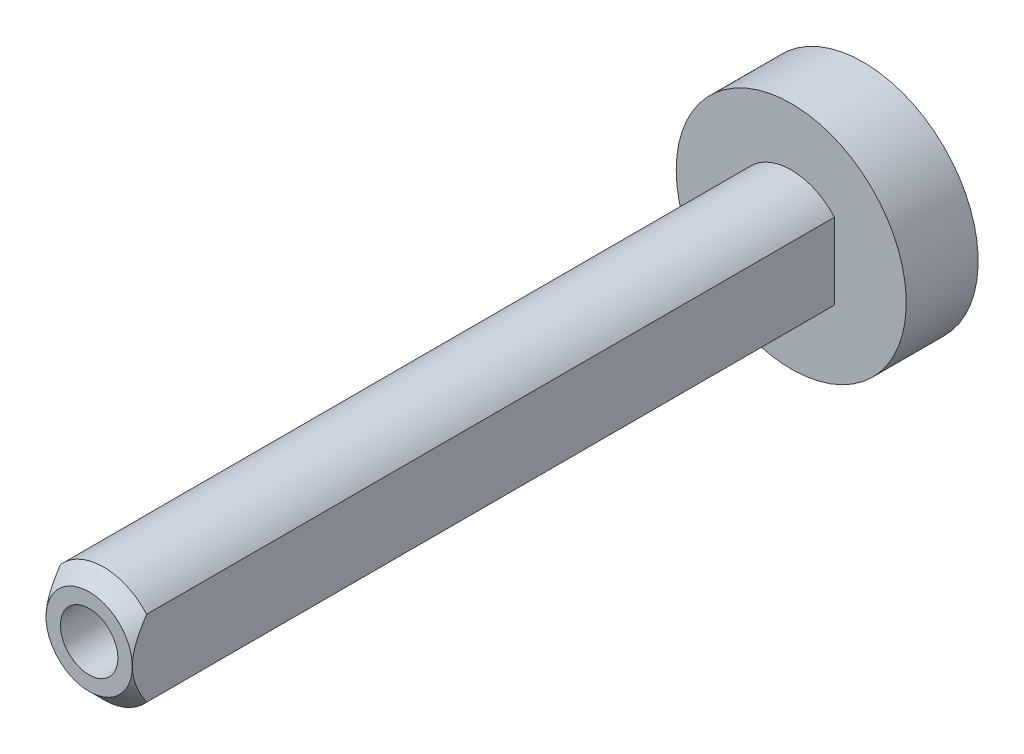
ISO-10303-21;
HEADER;
FILE_DESCRIPTION(('STEP AP214'),'2;1');
FILE_NAME('part.step','',(''),(''),'','','');
FILE_SCHEMA(('AUTOMOTIVE_DESIGN { 1 0 10303 214 1 1 1 1 }'));
ENDSEC;
DATA;
#1=APPLICATION_CONTEXT('core data for automotive mechanical design processes');
#2=APPLICATION_PROTOCOL_DEFINITION('international standard','automotive_design',2000,#1);
#3=PRODUCT_CONTEXT('',#1,'mechanical');
#4=PRODUCT('Part','Part','',(#3));
#5=PRODUCT_RELATED_PRODUCT_CATEGORY('part','',(#4));
#6=PRODUCT_DEFINITION_FORMATION('','',#4);
#7=PRODUCT_DEFINITION_CONTEXT('part definition',#1,'design');
#8=PRODUCT_DEFINITION('design','',#6,#7);
#9=PRODUCT_DEFINITION_SHAPE('','',#8);
#10=(LENGTH_UNIT() NAMED_UNIT(*) SI_UNIT(.MILLI.,.METRE.));
#11=(NAMED_UNIT(*) PLANE_ANGLE_UNIT() SI_UNIT($,.RADIAN.));
#12=(NAMED_UNIT(*) SI_UNIT($,.STERADIAN.) SOLID_ANGLE_UNIT());
#13=UNCERTAINTY_MEASURE_WITH_UNIT(LENGTH_MEASURE(1.E-05),#10,'distance_accuracy_value','');
#14=(GEOMETRIC_REPRESENTATION_CONTEXT(3) GLOBAL_UNCERTAINTY_ASSIGNED_CONTEXT((#13)) GLOBAL_UNIT_ASSIGNED_CONTEXT((#10,
#11,#12)) REPRESENTATION_CONTEXT('',''));
#15=CARTESIAN_POINT('',(0.,0.,0.));
#16=DIRECTION('',(0.,0.,1.));
#17=DIRECTION('',(1.,0.,0.));
#18=AXIS2_PLACEMENT_3D('',#15,#16,#17);
#19=CARTESIAN_POINT('',(0.,0.,53.83));
#20=DIRECTION('',(0.,0.,-1.));
#21=DIRECTION('',(-1.,0.,0.));
#22=AXIS2_PLACEMENT_3D('',#19,#20,#21);
#23=CYLINDRICAL_SURFACE('',#22,4.);
#24=CARTESIAN_POINT('',(0.,0.,5.));
#25=DIRECTION('',(0.,0.,-1.));
#26=DIRECTION('',(-1.,0.,0.));
#27=AXIS2_PLACEMENT_3D('',#24,#25,#26);
#28=CIRCLE('',#27,4.);
#29=CARTESIAN_POINT('',(-3.,2.64575131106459,5.));
#30=VERTEX_POINT('',#29);
#31=CARTESIAN_POINT('',(3.,2.64575131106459,5.));
#32=VERTEX_POINT('',#31);
#33=EDGE_CURVE('E45',#30,#32,#28,.T.);
#34=ORIENTED_EDGE('',*,*,#33,.F.);
#35=DIRECTION('',(0.,0.,-1.));
#36=VECTOR('',#35,1.);
#37=CARTESIAN_POINT('',(-3.,2.64575131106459,53.83));
#38=LINE('',#37,#36);
#39=CARTESIAN_POINT('',(-3.,2.64575131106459,52.83));
#40=VERTEX_POINT('',#39);
#41=EDGE_CURVE('E221',#40,#30,#38,.T.);
#42=ORIENTED_EDGE('',*,*,#41,.F.);
#43=CARTESIAN_POINT('',(0.,0.,52.83));
#44=DIRECTION('',(0.,0.,1.));
#45=DIRECTION('',(1.,0.,0.));
#46=AXIS2_PLACEMENT_3D('',#43,#44,#45);
#47=CIRCLE('',#46,4.);
#48=CARTESIAN_POINT('',(3.,2.64575131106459,52.83));
#49=VERTEX_POINT('',#48);
#50=EDGE_CURVE('E237',#40,#49,#47,.F.);
#51=ORIENTED_EDGE('',*,*,#50,.T.);
#52=DIRECTION('',(0.,0.,-1.));
#53=VECTOR('',#52,1.);
#54=CARTESIAN_POINT('',(3.,2.64575131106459,53.83));
#55=LINE('',#54,#53);
#56=EDGE_CURVE('E219',#49,#32,#55,.T.);
#57=ORIENTED_EDGE('',*,*,#56,.T.);
#58=EDGE_LOOP('',(#34,#42,#51,#57));
#59=FACE_BOUND('',#58,.T.);
#60=ADVANCED_FACE('F26',(#59),#23,.T.);
#61=CARTESIAN_POINT('',(0.,0.,5.));
#62=DIRECTION('',(0.,0.,-1.));
#63=DIRECTION('',(-1.,0.,0.));
#64=AXIS2_PLACEMENT_3D('',#61,#62,#63);
#65=CIRCLE('',#64,4.);
#66=CARTESIAN_POINT('',(3.,-2.64575131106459,5.));
#67=VERTEX_POINT('',#66);
#68=CARTESIAN_POINT('',(-3.,-2.64575131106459,5.));
#69=VERTEX_POINT('',#68);
#70=EDGE_CURVE('E162',#67,#69,#65,.T.);
#71=ORIENTED_EDGE('',*,*,#70,.F.);
#72=DIRECTION('',(0.,0.,-1.));
#73=VECTOR('',#72,1.);
#74=CARTESIAN_POINT('',(3.,-2.64575131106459,53.83));
#75=LINE('',#74,#73);
#76=CARTESIAN_POINT('',(3.,-2.64575131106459,52.83));
#77=VERTEX_POINT('',#76);
#78=EDGE_CURVE('E218',#77,#67,#75,.T.);
#79=ORIENTED_EDGE('',*,*,#78,.F.);
#80=CARTESIAN_POINT('',(-3.,-2.64575131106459,52.83));
#81=VERTEX_POINT('',#80);
#82=EDGE_CURVE('E236',#77,#81,#47,.F.);
#83=ORIENTED_EDGE('',*,*,#82,.T.);
#84=DIRECTION('',(0.,0.,-1.));
#85=VECTOR('',#84,1.);
#86=CARTESIAN_POINT('',(-3.,-2.64575131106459,53.83));
#87=LINE('',#86,#85);
#88=EDGE_CURVE('E223',#81,#69,#87,.T.);
#89=ORIENTED_EDGE('',*,*,#88,.T.);
#90=EDGE_LOOP('',(#71,#79,#83,#89));
#91=FACE_BOUND('',#90,.T.);
#92=ADVANCED_FACE('F254',(#91),#23,.T.);
#93=CARTESIAN_POINT('',(-3.,2.64575131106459,53.83));
#94=DIRECTION('',(1.,0.,0.));
#95=DIRECTION('',(0.,0.,-1.));
#96=AXIS2_PLACEMENT_3D('',#93,#94,#95);
#97=PLANE('',#96);
#98=DIRECTION('',(0.,1.,0.));
#99=VECTOR('',#98,1.);
#100=CARTESIAN_POINT('',(-3.,-2.64575131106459,5.));
#101=LINE('',#100,#99);
#102=EDGE_CURVE('E52',#69,#30,#101,.T.);
#103=ORIENTED_EDGE('',*,*,#102,.F.);
#104=ORIENTED_EDGE('',*,*,#88,.F.);
#105=CARTESIAN_POINT('',(-3.,-5.3285540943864,50.7149784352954));
#106=CARTESIAN_POINT('',(-3.,-5.20108166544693,50.8260351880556));
#107=CARTESIAN_POINT('',(-3.,-5.07315126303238,50.9365723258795));
#108=CARTESIAN_POINT('',(-3.,-4.81612786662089,51.1563259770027));
#109=CARTESIAN_POINT('',(-3.,-4.6870346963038,51.2655422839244));
#110=CARTESIAN_POINT('',(-3.,-4.42662141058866,51.4830541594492));
#111=CARTESIAN_POINT('',(-3.,-4.29529221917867,51.5913388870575));
#112=CARTESIAN_POINT('',(-3.,-4.03094129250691,51.8058074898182));
#113=CARTESIAN_POINT('',(-3.,-3.89791967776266,51.9119915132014));
#114=CARTESIAN_POINT('',(-3.,-3.61894169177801,52.1301523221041));
#115=CARTESIAN_POINT('',(-3.,-3.4728085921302,52.2419039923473));
#116=CARTESIAN_POINT('',(-3.,-3.1773847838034,52.4612510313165));
#117=CARTESIAN_POINT('',(-3.,-3.02809335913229,52.5688454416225));
#118=CARTESIAN_POINT('',(-3.,-2.72593062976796,52.7779847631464));
#119=CARTESIAN_POINT('',(-3.,-2.57307063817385,52.879545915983));
#120=CARTESIAN_POINT('',(-3.,-2.26229854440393,53.0745605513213));
#121=CARTESIAN_POINT('',(-3.,-2.1043893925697,53.1680186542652));
#122=CARTESIAN_POINT('',(-3.,-1.8359737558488,53.3139327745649));
#123=CARTESIAN_POINT('',(-3.,-1.727253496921,53.3696565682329));
#124=CARTESIAN_POINT('',(-3.,-1.50654143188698,53.4743747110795));
#125=CARTESIAN_POINT('',(-3.,-1.39454875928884,53.5233672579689));
#126=CARTESIAN_POINT('',(-3.,-1.16857364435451,53.612094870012));
#127=CARTESIAN_POINT('',(-3.,-1.05463549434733,53.6519411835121));
#128=CARTESIAN_POINT('',(-3.,-0.823557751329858,53.7209601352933));
#129=CARTESIAN_POINT('',(-3.,-0.706419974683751,53.750138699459));
#130=CARTESIAN_POINT('',(-3.,-0.499758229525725,53.7898940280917));
#131=CARTESIAN_POINT('',(-3.,-0.410781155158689,53.8033135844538));
#132=CARTESIAN_POINT('',(-3.,-0.231996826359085,53.8223543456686));
#133=CARTESIAN_POINT('',(-3.,-0.142189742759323,53.827977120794));
#134=CARTESIAN_POINT('',(-3.,0.0375074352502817,53.8311097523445));
#135=CARTESIAN_POINT('',(-3.,0.127397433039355,53.8286250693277));
#136=CARTESIAN_POINT('',(-3.,0.306606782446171,53.8156987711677));
#137=CARTESIAN_POINT('',(-3.,0.39592602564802,53.8052556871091));
#138=CARTESIAN_POINT('',(-3.,0.596649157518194,53.7732410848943));
#139=CARTESIAN_POINT('',(-3.,0.707701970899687,53.7494693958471));
#140=CARTESIAN_POINT('',(-3.,0.927130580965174,53.6917946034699));
#141=CARTESIAN_POINT('',(-3.,1.03550519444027,53.6578871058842));
#142=CARTESIAN_POINT('',(-3.,1.25080453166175,53.5812710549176));
#143=CARTESIAN_POINT('',(-3.,1.35768626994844,53.538443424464));
#144=CARTESIAN_POINT('',(-3.,1.56843277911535,53.4460661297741));
#145=CARTESIAN_POINT('',(-3.,1.67229835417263,53.3965182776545));
#146=CARTESIAN_POINT('',(-3.,1.8650194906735,53.2983898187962));
#147=CARTESIAN_POINT('',(-3.,1.95418170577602,53.2504054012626));
#148=CARTESIAN_POINT('',(-3.,2.13063567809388,53.1511007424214));
#149=CARTESIAN_POINT('',(-3.,2.2179271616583,53.0997800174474));
#150=CARTESIAN_POINT('',(-3.,2.47745318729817,52.9417034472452));
#151=CARTESIAN_POINT('',(-3.,2.64721765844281,52.8308972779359));
#152=CARTESIAN_POINT('',(-3.,2.98240710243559,52.6015468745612));
#153=CARTESIAN_POINT('',(-3.,3.14781072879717,52.4829719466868));
#154=CARTESIAN_POINT('',(-3.,3.47471422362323,52.2407068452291));
#155=CARTESIAN_POINT('',(-3.,3.63621553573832,52.1170186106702));
#156=CARTESIAN_POINT('',(-3.,3.94170207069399,51.8773335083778));
#157=CARTESIAN_POINT('',(-3.,4.08594354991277,51.761661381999));
#158=CARTESIAN_POINT('',(-3.,4.37250344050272,51.5279323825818));
#159=CARTESIAN_POINT('',(-3.,4.51482164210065,51.4098752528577));
#160=CARTESIAN_POINT('',(-3.,4.79657514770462,51.1730263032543));
#161=CARTESIAN_POINT('',(-3.,4.93602496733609,51.0542517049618));
#162=CARTESIAN_POINT('',(-3.,5.21363513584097,50.8152605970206));
#163=CARTESIAN_POINT('',(-3.,5.35179574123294,50.6950443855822));
#164=CARTESIAN_POINT('',(-3.,5.48945977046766,50.5742691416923));
#165=B_SPLINE_CURVE_WITH_KNOTS('',3,(#105,#106,#107,#108,#109,#110,#111,#112,#113,#114,#115,
#116,#117,#118,#119,#120,#121,#122,#123,#124,#125,#126,#127,#128,#129,#130,#131,#132,#133,#134,
#135,#136,#137,#138,#139,#140,#141,#142,#143,#144,#145,#146,#147,#148,#149,#150,#151,#152,#153,
#154,#155,#156,#157,#158,#159,#160,#161,#162,#163,#164),.UNSPECIFIED.,.F.,.F.,(4,2,2,2,2,2,2,2,
2,2,2,2,2,2,2,2,2,2,2,2,2,2,2,2,2,2,2,2,2,4),(0.,0.507198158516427,1.01447456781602,
1.52510043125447,2.03569013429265,2.58753248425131,3.13950130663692,3.68990975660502,
4.24000226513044,4.60633543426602,4.97276649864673,5.33447153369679,5.69597533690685,
5.96561705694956,6.23520446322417,6.50461033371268,6.77406594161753,7.11418450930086,
7.45445074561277,7.79958955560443,8.14463548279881,8.44831478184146,8.75203820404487,
9.35989667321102,9.97032141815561,10.5805167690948,11.1351681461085,11.6898795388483,
12.2393984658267,12.7888056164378),.UNSPECIFIED.);
#166=CARTESIAN_POINT('',(-3.,0.,53.83));
#167=VERTEX_POINT('',#166);
#168=EDGE_CURVE('E244',#81,#167,#165,.T.);
#169=ORIENTED_EDGE('',*,*,#168,.T.);
#170=EDGE_CURVE('E239',#167,#40,#165,.T.);
#171=ORIENTED_EDGE('',*,*,#170,.T.);
#172=ORIENTED_EDGE('',*,*,#41,.T.);
#173=EDGE_LOOP('',(#103,#104,#169,#171,#172));
#174=FACE_BOUND('',#173,.T.);
#175=ADVANCED_FACE('F249',(#174),#97,.F.);
#176=CARTESIAN_POINT('',(3.,2.64575131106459,53.83));
#177=DIRECTION('',(-1.,0.,0.));
#178=DIRECTION('',(0.,0.,1.));
#179=AXIS2_PLACEMENT_3D('',#176,#177,#178);
#180=PLANE('',#179);
#181=DIRECTION('',(0.,-1.,0.));
#182=VECTOR('',#181,1.);
#183=CARTESIAN_POINT('',(3.,2.64575131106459,5.));
#184=LINE('',#183,#182);
#185=EDGE_CURVE('E159',#32,#67,#184,.T.);
#186=ORIENTED_EDGE('',*,*,#185,.F.);
#187=ORIENTED_EDGE('',*,*,#56,.F.);
#188=CARTESIAN_POINT('',(3.,-5.3285540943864,50.7149784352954));
#189=CARTESIAN_POINT('',(3.,-5.20108166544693,50.8260351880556));
#190=CARTESIAN_POINT('',(3.,-5.07315126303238,50.9365723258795));
#191=CARTESIAN_POINT('',(3.,-4.81612786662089,51.1563259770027));
#192=CARTESIAN_POINT('',(3.,-4.6870346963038,51.2655422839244));
#193=CARTESIAN_POINT('',(3.,-4.42662141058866,51.4830541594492));
#194=CARTESIAN_POINT('',(3.,-4.29529221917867,51.5913388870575));
#195=CARTESIAN_POINT('',(3.,-4.03094129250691,51.8058074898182));
#196=CARTESIAN_POINT('',(3.,-3.89791967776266,51.9119915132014));
#197=CARTESIAN_POINT('',(3.,-3.61894169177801,52.1301523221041));
#198=CARTESIAN_POINT('',(3.,-3.4728085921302,52.2419039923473));
#199=CARTESIAN_POINT('',(3.,-3.1773847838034,52.4612510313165));
#200=CARTESIAN_POINT('',(3.,-3.02809335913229,52.5688454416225));
#201=CARTESIAN_POINT('',(3.,-2.72593062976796,52.7779847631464));
#202=CARTESIAN_POINT('',(3.,-2.57307063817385,52.879545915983));
#203=CARTESIAN_POINT('',(3.,-2.26229854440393,53.0745605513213));
#204=CARTESIAN_POINT('',(3.,-2.1043893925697,53.1680186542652));
#205=CARTESIAN_POINT('',(3.,-1.8359737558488,53.3139327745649));
#206=CARTESIAN_POINT('',(3.,-1.727253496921,53.3696565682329));
#207=CARTESIAN_POINT('',(3.,-1.50654143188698,53.4743747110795));
#208=CARTESIAN_POINT('',(3.,-1.39454875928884,53.5233672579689));
#209=CARTESIAN_POINT('',(3.,-1.16857364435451,53.612094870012));
#210=CARTESIAN_POINT('',(3.,-1.05463549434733,53.6519411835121));
#211=CARTESIAN_POINT('',(3.,-0.823557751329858,53.7209601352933));
#212=CARTESIAN_POINT('',(3.,-0.706419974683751,53.750138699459));
#213=CARTESIAN_POINT('',(3.,-0.499758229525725,53.7898940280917));
#214=CARTESIAN_POINT('',(3.,-0.410781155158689,53.8033135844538));
#215=CARTESIAN_POINT('',(3.,-0.231996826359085,53.8223543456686));
#216=CARTESIAN_POINT('',(3.,-0.142189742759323,53.827977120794));
#217=CARTESIAN_POINT('',(3.,0.0375074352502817,53.8311097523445));
#218=CARTESIAN_POINT('',(3.,0.127397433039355,53.8286250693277));
#219=CARTESIAN_POINT('',(3.,0.306606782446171,53.8156987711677));
#220=CARTESIAN_POINT('',(3.,0.39592602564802,53.8052556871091));
#221=CARTESIAN_POINT('',(3.,0.596649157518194,53.7732410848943));
#222=CARTESIAN_POINT('',(3.,0.707701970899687,53.7494693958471));
#223=CARTESIAN_POINT('',(3.,0.927130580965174,53.6917946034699));
#224=CARTESIAN_POINT('',(3.,1.03550519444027,53.6578871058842));
#225=CARTESIAN_POINT('',(3.,1.25080453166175,53.5812710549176));
#226=CARTESIAN_POINT('',(3.,1.35768626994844,53.538443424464));
#227=CARTESIAN_POINT('',(3.,1.56843277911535,53.4460661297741));
#228=CARTESIAN_POINT('',(3.,1.67229835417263,53.3965182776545));
#229=CARTESIAN_POINT('',(3.,1.8650194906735,53.2983898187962));
#230=CARTESIAN_POINT('',(3.,1.95418170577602,53.2504054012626));
#231=CARTESIAN_POINT('',(3.,2.13063567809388,53.1511007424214));
#232=CARTESIAN_POINT('',(3.,2.2179271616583,53.0997800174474));
#233=CARTESIAN_POINT('',(3.,2.47745318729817,52.9417034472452));
#234=CARTESIAN_POINT('',(3.,2.64721765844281,52.8308972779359));
#235=CARTESIAN_POINT('',(3.,2.98240710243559,52.6015468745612));
#236=CARTESIAN_POINT('',(3.,3.14781072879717,52.4829719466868));
#237=CARTESIAN_POINT('',(3.,3.47471422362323,52.2407068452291));
#238=CARTESIAN_POINT('',(3.,3.63621553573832,52.1170186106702));
#239=CARTESIAN_POINT('',(3.,3.94170207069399,51.8773335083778));
#240=CARTESIAN_POINT('',(3.,4.08594354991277,51.761661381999));
#241=CARTESIAN_POINT('',(3.,4.37250344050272,51.5279323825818));
#242=CARTESIAN_POINT('',(3.,4.51482164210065,51.4098752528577));
#243=CARTESIAN_POINT('',(3.,4.79657514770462,51.1730263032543));
#244=CARTESIAN_POINT('',(3.,4.93602496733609,51.0542517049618));
#245=CARTESIAN_POINT('',(3.,5.21363513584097,50.8152605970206));
#246=CARTESIAN_POINT('',(3.,5.35179574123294,50.6950443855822));
#247=CARTESIAN_POINT('',(3.,5.48945977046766,50.5742691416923));
#248=B_SPLINE_CURVE_WITH_KNOTS('',3,(#188,#189,#190,#191,#192,#193,#194,#195,#196,#197,#198,
#199,#200,#201,#202,#203,#204,#205,#206,#207,#208,#209,#210,#211,#212,#213,#214,#215,#216,#217,
#218,#219,#220,#221,#222,#223,#224,#225,#226,#227,#228,#229,#230,#231,#232,#233,#234,#235,#236,
#237,#238,#239,#240,#241,#242,#243,#244,#245,#246,#247),.UNSPECIFIED.,.F.,.F.,(4,2,2,2,2,2,2,2,
2,2,2,2,2,2,2,2,2,2,2,2,2,2,2,2,2,2,2,2,2,4),(0.,0.507198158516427,1.01447456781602,
1.52510043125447,2.03569013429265,2.58753248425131,3.13950130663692,3.68990975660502,
4.24000226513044,4.60633543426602,4.97276649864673,5.33447153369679,5.69597533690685,
5.96561705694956,6.23520446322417,6.50461033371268,6.77406594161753,7.11418450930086,
7.45445074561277,7.79958955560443,8.14463548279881,8.44831478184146,8.75203820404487,
9.35989667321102,9.97032141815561,10.5805167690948,11.1351681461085,11.6898795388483,
12.2393984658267,12.7888056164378),.UNSPECIFIED.);
#249=CARTESIAN_POINT('',(3.,0.,53.83));
#250=VERTEX_POINT('',#249);
#251=EDGE_CURVE('E11',#49,#250,#248,.F.);
#252=ORIENTED_EDGE('',*,*,#251,.T.);
#253=EDGE_CURVE('E29',#250,#77,#248,.F.);
#254=ORIENTED_EDGE('',*,*,#253,.T.);
#255=ORIENTED_EDGE('',*,*,#78,.T.);
#256=EDGE_LOOP('',(#186,#187,#252,#254,#255));
#257=FACE_BOUND('',#256,.T.);
#258=ADVANCED_FACE('F253',(#257),#180,.F.);
#259=CARTESIAN_POINT('',(0.,0.,53.83));
#260=DIRECTION('',(0.,0.,-1.));
#261=DIRECTION('',(-1.,0.,0.));
#262=AXIS2_PLACEMENT_3D('',#259,#260,#261);
#263=CONICAL_SURFACE('',#262,3.,0.785398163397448);
#264=ORIENTED_EDGE('',*,*,#251,.F.);
#265=ORIENTED_EDGE('',*,*,#50,.F.);
#266=ORIENTED_EDGE('',*,*,#170,.F.);
#267=CARTESIAN_POINT('',(0.,0.,53.83));
#268=DIRECTION('',(0.,0.,1.));
#269=DIRECTION('',(1.,0.,0.));
#270=AXIS2_PLACEMENT_3D('',#267,#268,#269);
#271=CIRCLE('',#270,3.);
#272=EDGE_CURVE('E232',#250,#167,#271,.T.);
#273=ORIENTED_EDGE('',*,*,#272,.F.);
#274=EDGE_LOOP('',(#264,#265,#266,#273));
#275=FACE_BOUND('',#274,.T.);
#276=ADVANCED_FACE('F269',(#275),#263,.T.);
#277=CARTESIAN_POINT('',(0.,0.,53.83));
#278=DIRECTION('',(0.,0.,1.));
#279=DIRECTION('',(1.,0.,0.));
#280=AXIS2_PLACEMENT_3D('',#277,#278,#279);
#281=PLANE('',#280);
#282=CARTESIAN_POINT('',(0.,0.,53.83));
#283=DIRECTION('',(0.,0.,1.));
#284=DIRECTION('',(1.,0.,0.));
#285=AXIS2_PLACEMENT_3D('',#282,#283,#284);
#286=CIRCLE('',#285,2.);
#287=CARTESIAN_POINT('',(2.,0.,53.83));
#288=VERTEX_POINT('',#287);
#289=EDGE_CURVE('E225',#288,#288,#286,.T.);
#290=ORIENTED_EDGE('',*,*,#289,.F.);
#291=EDGE_LOOP('',(#290));
#292=FACE_BOUND('',#291,.T.);
#293=EDGE_CURVE('E233',#167,#250,#271,.T.);
#294=ORIENTED_EDGE('',*,*,#293,.T.);
#295=ORIENTED_EDGE('',*,*,#272,.T.);
#296=EDGE_LOOP('',(#294,#295));
#297=FACE_BOUND('',#296,.T.);
#298=ADVANCED_FACE('F267',(#292,#297),#281,.T.);
#299=ORIENTED_EDGE('',*,*,#253,.F.);
#300=ORIENTED_EDGE('',*,*,#293,.F.);
#301=ORIENTED_EDGE('',*,*,#168,.F.);
#302=ORIENTED_EDGE('',*,*,#82,.F.);
#303=EDGE_LOOP('',(#299,#300,#301,#302));
#304=FACE_BOUND('',#303,.T.);
#305=ADVANCED_FACE('F245',(#304),#263,.T.);
#306=CARTESIAN_POINT('',(0.,0.,45.83));
#307=DIRECTION('',(0.,0.,1.));
#308=DIRECTION('',(1.,0.,0.));
#309=AXIS2_PLACEMENT_3D('',#306,#307,#308);
#310=CYLINDRICAL_SURFACE('',#309,2.);
#311=CARTESIAN_POINT('',(0.,0.,45.83));
#312=DIRECTION('',(0.,0.,1.));
#313=DIRECTION('',(1.,0.,0.));
#314=AXIS2_PLACEMENT_3D('',#311,#312,#313);
#315=CIRCLE('',#314,2.);
#316=CARTESIAN_POINT('',(2.,0.,45.83));
#317=VERTEX_POINT('',#316);
#318=EDGE_CURVE('E229',#317,#317,#315,.T.);
#319=ORIENTED_EDGE('',*,*,#318,.F.);
#320=EDGE_LOOP('',(#319));
#321=FACE_BOUND('',#320,.T.);
#322=ORIENTED_EDGE('',*,*,#289,.T.);
#323=EDGE_LOOP('',(#322));
#324=FACE_BOUND('',#323,.T.);
#325=ADVANCED_FACE('F260',(#321,#324),#310,.F.);
#326=CARTESIAN_POINT('',(0.,0.,45.83));
#327=DIRECTION('',(0.,0.,1.));
#328=DIRECTION('',(1.,0.,0.));
#329=AXIS2_PLACEMENT_3D('',#326,#327,#328);
#330=PLANE('',#329);
#331=ORIENTED_EDGE('',*,*,#318,.T.);
#332=EDGE_LOOP('',(#331));
#333=FACE_BOUND('',#332,.T.);
#334=ADVANCED_FACE('F257',(#333),#330,.T.);
#335=CARTESIAN_POINT('',(0.,0.,5.));
#336=DIRECTION('',(0.,0.,-1.));
#337=DIRECTION('',(-1.,0.,0.));
#338=AXIS2_PLACEMENT_3D('',#335,#336,#337);
#339=CYLINDRICAL_SURFACE('',#338,8.);
#340=CARTESIAN_POINT('',(0.,0.,5.));
#341=DIRECTION('',(0.,0.,-1.));
#342=DIRECTION('',(-1.,0.,0.));
#343=AXIS2_PLACEMENT_3D('',#340,#341,#342);
#344=CIRCLE('',#343,8.);
#345=CARTESIAN_POINT('',(-8.,0.,5.));
#346=VERTEX_POINT('',#345);
#347=EDGE_CURVE('E173',#346,#346,#344,.T.);
#348=ORIENTED_EDGE('',*,*,#347,.T.);
#349=EDGE_LOOP('',(#348));
#350=FACE_BOUND('',#349,.T.);
#351=CARTESIAN_POINT('',(0.,0.,0.));
#352=DIRECTION('',(0.,0.,-1.));
#353=DIRECTION('',(-1.,0.,0.));
#354=AXIS2_PLACEMENT_3D('',#351,#352,#353);
#355=CIRCLE('',#354,8.);
#356=CARTESIAN_POINT('',(-8.,0.,0.));
#357=VERTEX_POINT('',#356);
#358=EDGE_CURVE('E168',#357,#357,#355,.T.);
#359=ORIENTED_EDGE('',*,*,#358,.F.);
#360=EDGE_LOOP('',(#359));
#361=FACE_BOUND('',#360,.T.);
#362=ADVANCED_FACE('F259',(#350,#361),#339,.T.);
#363=CARTESIAN_POINT('',(0.,0.,5.));
#364=DIRECTION('',(0.,0.,-1.));
#365=DIRECTION('',(-1.,0.,0.));
#366=AXIS2_PLACEMENT_3D('',#363,#364,#365);
#367=PLANE('',#366);
#368=ORIENTED_EDGE('',*,*,#102,.T.);
#369=ORIENTED_EDGE('',*,*,#33,.T.);
#370=ORIENTED_EDGE('',*,*,#185,.T.);
#371=ORIENTED_EDGE('',*,*,#70,.T.);
#372=EDGE_LOOP('',(#368,#369,#370,#371));
#373=FACE_BOUND('',#372,.T.);
#374=ORIENTED_EDGE('',*,*,#347,.F.);
#375=EDGE_LOOP('',(#374));
#376=FACE_BOUND('',#375,.T.);
#377=ADVANCED_FACE('F284',(#373,#376),#367,.F.);
#378=CARTESIAN_POINT('',(0.,0.,0.));
#379=DIRECTION('',(0.,0.,-1.));
#380=DIRECTION('',(-1.,0.,0.));
#381=AXIS2_PLACEMENT_3D('',#378,#379,#380);
#382=PLANE('',#381);
#383=CARTESIAN_POINT('',(0.,0.,0.));
#384=DIRECTION('',(0.,0.,-1.));
#385=DIRECTION('',(-1.,0.,0.));
#386=AXIS2_PLACEMENT_3D('',#383,#384,#385);
#387=CIRCLE('',#386,4.);
#388=CARTESIAN_POINT('',(-3.,2.64575131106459,0.));
#389=VERTEX_POINT('',#388);
#390=CARTESIAN_POINT('',(3.,2.64575131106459,0.));
#391=VERTEX_POINT('',#390);
#392=EDGE_CURVE('E148',#389,#391,#387,.T.);
#393=ORIENTED_EDGE('',*,*,#392,.F.);
#394=DIRECTION('',(0.,1.,0.));
#395=VECTOR('',#394,1.);
#396=CARTESIAN_POINT('',(-3.,-2.64575131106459,0.));
#397=LINE('',#396,#395);
#398=CARTESIAN_POINT('',(-3.,-2.64575131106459,0.));
#399=VERTEX_POINT('',#398);
#400=EDGE_CURVE('E153',#399,#389,#397,.T.);
#401=ORIENTED_EDGE('',*,*,#400,.F.);
#402=CARTESIAN_POINT('',(0.,0.,0.));
#403=DIRECTION('',(0.,0.,-1.));
#404=DIRECTION('',(-1.,0.,0.));
#405=AXIS2_PLACEMENT_3D('',#402,#403,#404);
#406=CIRCLE('',#405,4.);
#407=CARTESIAN_POINT('',(3.,-2.64575131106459,0.));
#408=VERTEX_POINT('',#407);
#409=EDGE_CURVE('E132',#408,#399,#406,.T.);
#410=ORIENTED_EDGE('',*,*,#409,.F.);
#411=DIRECTION('',(0.,-1.,0.));
#412=VECTOR('',#411,1.);
#413=CARTESIAN_POINT('',(3.,2.64575131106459,0.));
#414=LINE('',#413,#412);
#415=EDGE_CURVE('E142',#391,#408,#414,.T.);
#416=ORIENTED_EDGE('',*,*,#415,.F.);
#417=EDGE_LOOP('',(#393,#401,#410,#416));
#418=FACE_BOUND('',#417,.T.);
#419=ORIENTED_EDGE('',*,*,#358,.T.);
#420=EDGE_LOOP('',(#419));
#421=FACE_BOUND('',#420,.T.);
#422=ADVANCED_FACE('F150',(#418,#421),#382,.T.);
#423=CARTESIAN_POINT('',(0.,0.,5.));
#424=DIRECTION('',(0.,0.,-1.));
#425=DIRECTION('',(-1.,0.,0.));
#426=AXIS2_PLACEMENT_3D('',#423,#424,#425);
#427=CYLINDRICAL_SURFACE('',#426,4.);
#428=CARTESIAN_POINT('',(0.,0.,1.));
#429=DIRECTION('',(0.,0.,-1.));
#430=DIRECTION('',(-1.,0.,0.));
#431=AXIS2_PLACEMENT_3D('',#428,#429,#430);
#432=CIRCLE('',#431,4.);
#433=CARTESIAN_POINT('',(-3.,2.64575131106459,1.));
#434=VERTEX_POINT('',#433);
#435=CARTESIAN_POINT('',(3.,2.64575131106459,1.));
#436=VERTEX_POINT('',#435);
#437=EDGE_CURVE('E203',#434,#436,#432,.T.);
#438=ORIENTED_EDGE('',*,*,#437,.F.);
#439=DIRECTION('',(0.,0.,-1.));
#440=VECTOR('',#439,1.);
#441=CARTESIAN_POINT('',(-3.,2.64575131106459,5.));
#442=LINE('',#441,#440);
#443=EDGE_CURVE('E166',#434,#389,#442,.T.);
#444=ORIENTED_EDGE('',*,*,#443,.T.);
#445=ORIENTED_EDGE('',*,*,#392,.T.);
#446=DIRECTION('',(0.,0.,-1.));
#447=VECTOR('',#446,1.);
#448=CARTESIAN_POINT('',(3.,2.64575131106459,5.));
#449=LINE('',#448,#447);
#450=EDGE_CURVE('E139',#436,#391,#449,.T.);
#451=ORIENTED_EDGE('',*,*,#450,.F.);
#452=EDGE_LOOP('',(#438,#444,#445,#451));
#453=FACE_BOUND('',#452,.T.);
#454=ADVANCED_FACE('F333',(#453),#427,.F.);
#455=CARTESIAN_POINT('',(-3.,-2.64575131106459,5.));
#456=DIRECTION('',(-1.,0.,0.));
#457=DIRECTION('',(0.,0.,1.));
#458=AXIS2_PLACEMENT_3D('',#455,#456,#457);
#459=PLANE('',#458);
#460=DIRECTION('',(0.,1.,0.));
#461=VECTOR('',#460,1.);
#462=CARTESIAN_POINT('',(-3.,-2.64575131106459,1.));
#463=LINE('',#462,#461);
#464=CARTESIAN_POINT('',(-3.,-2.64575131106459,1.));
#465=VERTEX_POINT('',#464);
#466=EDGE_CURVE('E215',#465,#434,#463,.T.);
#467=ORIENTED_EDGE('',*,*,#466,.F.);
#468=DIRECTION('',(0.,0.,-1.));
#469=VECTOR('',#468,1.);
#470=CARTESIAN_POINT('',(-3.,-2.64575131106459,5.));
#471=LINE('',#470,#469);
#472=EDGE_CURVE('E138',#465,#399,#471,.T.);
#473=ORIENTED_EDGE('',*,*,#472,.T.);
#474=ORIENTED_EDGE('',*,*,#400,.T.);
#475=ORIENTED_EDGE('',*,*,#443,.F.);
#476=EDGE_LOOP('',(#467,#473,#474,#475));
#477=FACE_BOUND('',#476,.T.);
#478=ADVANCED_FACE('F335',(#477),#459,.F.);
#479=CARTESIAN_POINT('',(0.,0.,5.));
#480=DIRECTION('',(0.,0.,-1.));
#481=DIRECTION('',(-1.,0.,0.));
#482=AXIS2_PLACEMENT_3D('',#479,#480,#481);
#483=CYLINDRICAL_SURFACE('',#482,4.);
#484=CARTESIAN_POINT('',(0.,0.,1.));
#485=DIRECTION('',(0.,0.,-1.));
#486=DIRECTION('',(-1.,0.,0.));
#487=AXIS2_PLACEMENT_3D('',#484,#485,#486);
#488=CIRCLE('',#487,4.);
#489=CARTESIAN_POINT('',(3.,-2.64575131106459,1.));
#490=VERTEX_POINT('',#489);
#491=EDGE_CURVE('E135',#490,#465,#488,.T.);
#492=ORIENTED_EDGE('',*,*,#491,.F.);
#493=DIRECTION('',(0.,0.,-1.));
#494=VECTOR('',#493,1.);
#495=CARTESIAN_POINT('',(3.,-2.64575131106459,5.));
#496=LINE('',#495,#494);
#497=EDGE_CURVE('E127',#490,#408,#496,.T.);
#498=ORIENTED_EDGE('',*,*,#497,.T.);
#499=ORIENTED_EDGE('',*,*,#409,.T.);
#500=ORIENTED_EDGE('',*,*,#472,.F.);
#501=EDGE_LOOP('',(#492,#498,#499,#500));
#502=FACE_BOUND('',#501,.T.);
#503=ADVANCED_FACE('F129',(#502),#483,.F.);
#504=CARTESIAN_POINT('',(3.,2.64575131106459,5.));
#505=DIRECTION('',(1.,0.,0.));
#506=DIRECTION('',(0.,1.,0.));
#507=AXIS2_PLACEMENT_3D('',#504,#505,#506);
#508=PLANE('',#507);
#509=DIRECTION('',(0.,-1.,0.));
#510=VECTOR('',#509,1.);
#511=CARTESIAN_POINT('',(3.,2.64575131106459,1.));
#512=LINE('',#511,#510);
#513=EDGE_CURVE('E212',#436,#490,#512,.T.);
#514=ORIENTED_EDGE('',*,*,#513,.F.);
#515=ORIENTED_EDGE('',*,*,#450,.T.);
#516=ORIENTED_EDGE('',*,*,#415,.T.);
#517=ORIENTED_EDGE('',*,*,#497,.F.);
#518=EDGE_LOOP('',(#514,#515,#516,#517));
#519=FACE_BOUND('',#518,.T.);
#520=ADVANCED_FACE('F143',(#519),#508,.F.);
#521=CARTESIAN_POINT('',(0.,0.,0.));
#522=DIRECTION('',(0.,0.,1.));
#523=DIRECTION('',(1.,0.,0.));
#524=AXIS2_PLACEMENT_3D('',#521,#522,#523);
#525=PLANE('',#524);
#526=CARTESIAN_POINT('',(0.,0.,0.));
#527=DIRECTION('',(0.,0.,-1.));
#528=DIRECTION('',(-1.,0.,0.));
#529=AXIS2_PLACEMENT_3D('',#526,#527,#528);
#530=CIRCLE('',#529,3.);
#531=CARTESIAN_POINT('',(-2.,2.23606797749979,0.));
#532=VERTEX_POINT('',#531);
#533=CARTESIAN_POINT('',(2.,2.23606797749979,0.));
#534=VERTEX_POINT('',#533);
#535=EDGE_CURVE('E176',#532,#534,#530,.T.);
#536=ORIENTED_EDGE('',*,*,#535,.T.);
#537=DIRECTION('',(0.,-1.,0.));
#538=VECTOR('',#537,1.);
#539=CARTESIAN_POINT('',(2.,2.23606797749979,0.));
#540=LINE('',#539,#538);
#541=CARTESIAN_POINT('',(2.,-2.23606797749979,0.));
#542=VERTEX_POINT('',#541);
#543=EDGE_CURVE('E179',#534,#542,#540,.T.);
#544=ORIENTED_EDGE('',*,*,#543,.T.);
#545=CARTESIAN_POINT('',(0.,0.,0.));
#546=DIRECTION('',(0.,0.,-1.));
#547=DIRECTION('',(-1.,0.,0.));
#548=AXIS2_PLACEMENT_3D('',#545,#546,#547);
#549=CIRCLE('',#548,3.);
#550=CARTESIAN_POINT('',(-2.,-2.23606797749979,0.));
#551=VERTEX_POINT('',#550);
#552=EDGE_CURVE('E182',#542,#551,#549,.T.);
#553=ORIENTED_EDGE('',*,*,#552,.T.);
#554=DIRECTION('',(0.,1.,0.));
#555=VECTOR('',#554,1.);
#556=CARTESIAN_POINT('',(-2.,-2.23606797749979,0.));
#557=LINE('',#556,#555);
#558=EDGE_CURVE('E185',#551,#532,#557,.T.);
#559=ORIENTED_EDGE('',*,*,#558,.T.);
#560=EDGE_LOOP('',(#536,#544,#553,#559));
#561=FACE_BOUND('',#560,.T.);
#562=ADVANCED_FACE('F303',(#561),#525,.F.);
#563=CARTESIAN_POINT('',(0.,0.,1.));
#564=DIRECTION('',(0.,0.,-1.));
#565=DIRECTION('',(-1.,0.,0.));
#566=AXIS2_PLACEMENT_3D('',#563,#564,#565);
#567=CYLINDRICAL_SURFACE('',#566,3.);
#568=ORIENTED_EDGE('',*,*,#535,.F.);
#569=DIRECTION('',(0.,0.,-1.));
#570=VECTOR('',#569,1.);
#571=CARTESIAN_POINT('',(-2.,2.23606797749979,1.));
#572=LINE('',#571,#570);
#573=CARTESIAN_POINT('',(-2.,2.23606797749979,1.));
#574=VERTEX_POINT('',#573);
#575=EDGE_CURVE('E201',#574,#532,#572,.T.);
#576=ORIENTED_EDGE('',*,*,#575,.F.);
#577=CARTESIAN_POINT('',(0.,0.,1.));
#578=DIRECTION('',(0.,0.,-1.));
#579=DIRECTION('',(-1.,0.,0.));
#580=AXIS2_PLACEMENT_3D('',#577,#578,#579);
#581=CIRCLE('',#580,3.);
#582=CARTESIAN_POINT('',(2.,2.23606797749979,1.));
#583=VERTEX_POINT('',#582);
#584=EDGE_CURVE('E188',#574,#583,#581,.T.);
#585=ORIENTED_EDGE('',*,*,#584,.T.);
#586=DIRECTION('',(0.,0.,-1.));
#587=VECTOR('',#586,1.);
#588=CARTESIAN_POINT('',(2.,2.23606797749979,1.));
#589=LINE('',#588,#587);
#590=EDGE_CURVE('E200',#583,#534,#589,.T.);
#591=ORIENTED_EDGE('',*,*,#590,.T.);
#592=EDGE_LOOP('',(#568,#576,#585,#591));
#593=FACE_BOUND('',#592,.T.);
#594=ADVANCED_FACE('F304',(#593),#567,.T.);
#595=CARTESIAN_POINT('',(2.,2.23606797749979,1.));
#596=DIRECTION('',(1.,0.,0.));
#597=DIRECTION('',(0.,0.,-1.));
#598=AXIS2_PLACEMENT_3D('',#595,#596,#597);
#599=PLANE('',#598);
#600=ORIENTED_EDGE('',*,*,#543,.F.);
#601=ORIENTED_EDGE('',*,*,#590,.F.);
#602=DIRECTION('',(0.,-1.,0.));
#603=VECTOR('',#602,1.);
#604=CARTESIAN_POINT('',(2.,2.23606797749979,1.));
#605=LINE('',#604,#603);
#606=CARTESIAN_POINT('',(2.,-2.23606797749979,1.));
#607=VERTEX_POINT('',#606);
#608=EDGE_CURVE('E191',#583,#607,#605,.T.);
#609=ORIENTED_EDGE('',*,*,#608,.T.);
#610=DIRECTION('',(0.,0.,-1.));
#611=VECTOR('',#610,1.);
#612=CARTESIAN_POINT('',(2.,-2.23606797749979,1.));
#613=LINE('',#612,#611);
#614=EDGE_CURVE('E206',#607,#542,#613,.T.);
#615=ORIENTED_EDGE('',*,*,#614,.T.);
#616=EDGE_LOOP('',(#600,#601,#609,#615));
#617=FACE_BOUND('',#616,.T.);
#618=ADVANCED_FACE('F310',(#617),#599,.T.);
#619=CARTESIAN_POINT('',(0.,0.,1.));
#620=DIRECTION('',(0.,0.,-1.));
#621=DIRECTION('',(-1.,0.,0.));
#622=AXIS2_PLACEMENT_3D('',#619,#620,#621);
#623=CYLINDRICAL_SURFACE('',#622,3.);
#624=ORIENTED_EDGE('',*,*,#552,.F.);
#625=ORIENTED_EDGE('',*,*,#614,.F.);
#626=CARTESIAN_POINT('',(0.,0.,1.));
#627=DIRECTION('',(0.,0.,-1.));
#628=DIRECTION('',(-1.,0.,0.));
#629=AXIS2_PLACEMENT_3D('',#626,#627,#628);
#630=CIRCLE('',#629,3.);
#631=CARTESIAN_POINT('',(-2.,-2.23606797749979,1.));
#632=VERTEX_POINT('',#631);
#633=EDGE_CURVE('E194',#607,#632,#630,.T.);
#634=ORIENTED_EDGE('',*,*,#633,.T.);
#635=DIRECTION('',(0.,0.,-1.));
#636=VECTOR('',#635,1.);
#637=CARTESIAN_POINT('',(-2.,-2.23606797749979,1.));
#638=LINE('',#637,#636);
#639=EDGE_CURVE('E204',#632,#551,#638,.T.);
#640=ORIENTED_EDGE('',*,*,#639,.T.);
#641=EDGE_LOOP('',(#624,#625,#634,#640));
#642=FACE_BOUND('',#641,.T.);
#643=ADVANCED_FACE('F323',(#642),#623,.T.);
#644=CARTESIAN_POINT('',(-2.,-2.23606797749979,1.));
#645=DIRECTION('',(-1.,0.,0.));
#646=DIRECTION('',(0.,0.,1.));
#647=AXIS2_PLACEMENT_3D('',#644,#645,#646);
#648=PLANE('',#647);
#649=ORIENTED_EDGE('',*,*,#558,.F.);
#650=ORIENTED_EDGE('',*,*,#639,.F.);
#651=DIRECTION('',(0.,1.,0.));
#652=VECTOR('',#651,1.);
#653=CARTESIAN_POINT('',(-2.,-2.23606797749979,1.));
#654=LINE('',#653,#652);
#655=EDGE_CURVE('E197',#632,#574,#654,.T.);
#656=ORIENTED_EDGE('',*,*,#655,.T.);
#657=ORIENTED_EDGE('',*,*,#575,.T.);
#658=EDGE_LOOP('',(#649,#650,#656,#657));
#659=FACE_BOUND('',#658,.T.);
#660=ADVANCED_FACE('F326',(#659),#648,.T.);
#661=CARTESIAN_POINT('',(0.,0.,1.));
#662=DIRECTION('',(0.,0.,-1.));
#663=DIRECTION('',(-1.,0.,0.));
#664=AXIS2_PLACEMENT_3D('',#661,#662,#663);
#665=PLANE('',#664);
#666=ORIENTED_EDGE('',*,*,#655,.F.);
#667=ORIENTED_EDGE('',*,*,#633,.F.);
#668=ORIENTED_EDGE('',*,*,#608,.F.);
#669=ORIENTED_EDGE('',*,*,#584,.F.);
#670=EDGE_LOOP('',(#666,#667,#668,#669));
#671=FACE_BOUND('',#670,.T.);
#672=ORIENTED_EDGE('',*,*,#437,.T.);
#673=ORIENTED_EDGE('',*,*,#513,.T.);
#674=ORIENTED_EDGE('',*,*,#491,.T.);
#675=ORIENTED_EDGE('',*,*,#466,.T.);
#676=EDGE_LOOP('',(#672,#673,#674,#675));
#677=FACE_BOUND('',#676,.T.);
#678=ADVANCED_FACE('F328',(#671,#677),#665,.T.);
#679=CLOSED_SHELL('',(#60,#92,#175,#258,#276,#298,#305,#325,#334,#362,#377,#422,#454,#478,#503,
#520,#562,#594,#618,#643,#660,#678));
#680=MANIFOLD_SOLID_BREP('B2',#679);
#681=ADVANCED_BREP_SHAPE_REPRESENTATION('',(#18,#680),#14);
#682=SHAPE_DEFINITION_REPRESENTATION(#9,#681);
ENDSEC;
END-ISO-10303-21;
